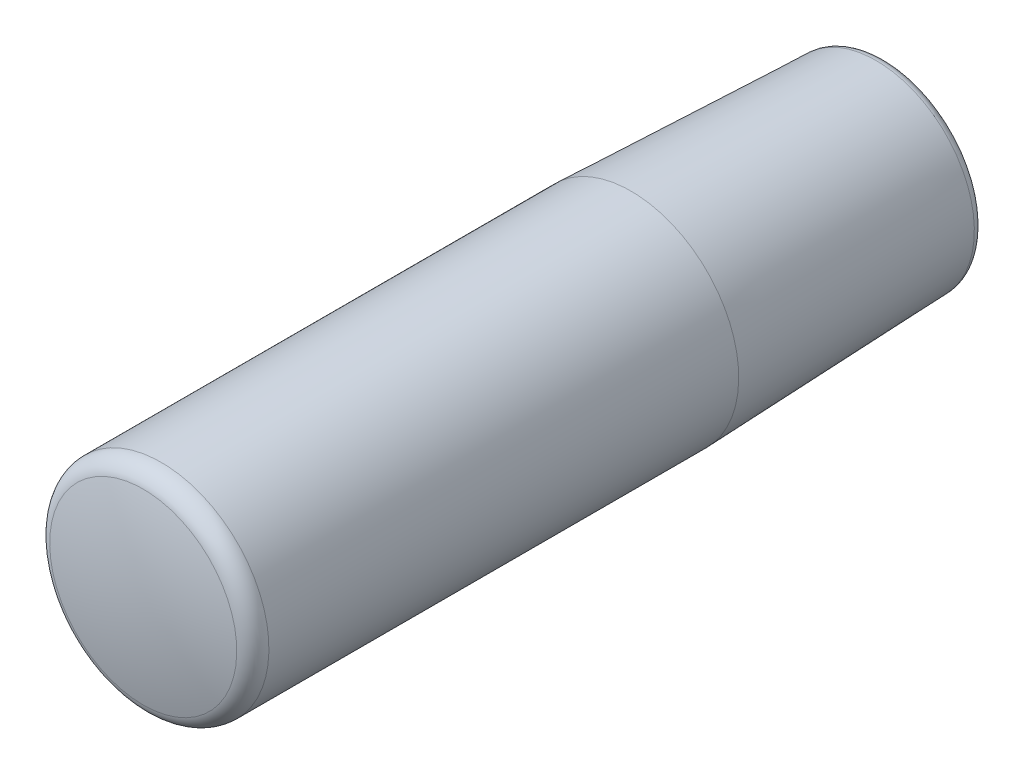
ISO-10303-21;
HEADER;
FILE_DESCRIPTION(('STEP AP214'),'2;1');
FILE_NAME('part.step','',(''),(''),'','','');
FILE_SCHEMA(('AUTOMOTIVE_DESIGN { 1 0 10303 214 1 1 1 1 }'));
ENDSEC;
DATA;
#1=APPLICATION_CONTEXT('core data for automotive mechanical design processes');
#2=APPLICATION_PROTOCOL_DEFINITION('international standard','automotive_design',2000,#1);
#3=PRODUCT_CONTEXT('',#1,'mechanical');
#4=PRODUCT('Part','Part','',(#3));
#5=PRODUCT_RELATED_PRODUCT_CATEGORY('part','',(#4));
#6=PRODUCT_DEFINITION_FORMATION('','',#4);
#7=PRODUCT_DEFINITION_CONTEXT('part definition',#1,'design');
#8=PRODUCT_DEFINITION('design','',#6,#7);
#9=PRODUCT_DEFINITION_SHAPE('','',#8);
#10=(LENGTH_UNIT() NAMED_UNIT(*) SI_UNIT(.MILLI.,.METRE.));
#11=(NAMED_UNIT(*) PLANE_ANGLE_UNIT() SI_UNIT($,.RADIAN.));
#12=(NAMED_UNIT(*) SI_UNIT($,.STERADIAN.) SOLID_ANGLE_UNIT());
#13=UNCERTAINTY_MEASURE_WITH_UNIT(LENGTH_MEASURE(1.E-05),#10,'distance_accuracy_value','');
#14=(GEOMETRIC_REPRESENTATION_CONTEXT(3) GLOBAL_UNCERTAINTY_ASSIGNED_CONTEXT((#13)) GLOBAL_UNIT_ASSIGNED_CONTEXT((#10,
#11,#12)) REPRESENTATION_CONTEXT('',''));
#15=CARTESIAN_POINT('',(0.,0.,0.));
#16=DIRECTION('',(0.,0.,1.));
#17=DIRECTION('',(1.,0.,0.));
#18=AXIS2_PLACEMENT_3D('',#15,#16,#17);
#19=CARTESIAN_POINT('',(0.,0.,1.));
#20=DIRECTION('',(0.,0.,-1.));
#21=DIRECTION('',(0.,-1.,0.));
#22=AXIS2_PLACEMENT_3D('',#19,#20,#21);
#23=TOROIDAL_SURFACE('',#22,9.03772216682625,1.);
#24=CARTESIAN_POINT('',(0.,0.,0.));
#25=DIRECTION('',(0.,0.,-1.));
#26=DIRECTION('',(0.,-1.,0.));
#27=AXIS2_PLACEMENT_3D('',#24,#25,#26);
#28=CIRCLE('',#27,9.03772216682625);
#29=CARTESIAN_POINT('',(0.,-9.03772216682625,0.));
#30=VERTEX_POINT('',#29);
#31=EDGE_CURVE('E8',#30,#30,#28,.T.);
#32=ORIENTED_EDGE('',*,*,#31,.F.);
#33=EDGE_LOOP('',(#32));
#34=FACE_BOUND('',#33,.T.);
#35=CARTESIAN_POINT('',(0.,0.,0.961566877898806));
#36=DIRECTION('',(0.,0.,-1.));
#37=DIRECTION('',(0.,-1.,0.));
#38=AXIS2_PLACEMENT_3D('',#35,#36,#37);
#39=CIRCLE('',#38,10.0369833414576);
#40=CARTESIAN_POINT('',(0.,-10.0369833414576,0.961566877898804));
#41=VERTEX_POINT('',#40);
#42=EDGE_CURVE('E34',#41,#41,#39,.T.);
#43=ORIENTED_EDGE('',*,*,#42,.T.);
#44=EDGE_LOOP('',(#43));
#45=FACE_BOUND('',#44,.T.);
#46=ADVANCED_FACE('F12',(#34,#45),#23,.T.);
#47=CARTESIAN_POINT('',(0.,9.0377221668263,0.));
#48=DIRECTION('',(0.,0.,1.));
#49=DIRECTION('',(0.,1.,0.));
#50=AXIS2_PLACEMENT_3D('',#47,#48,#49);
#51=PLANE('',#50);
#52=CARTESIAN_POINT('',(0.,0.,0.));
#53=DIRECTION('',(0.,0.,-1.));
#54=DIRECTION('',(0.,-1.,0.));
#55=AXIS2_PLACEMENT_3D('',#52,#53,#54);
#56=CIRCLE('',#55,5.);
#57=CARTESIAN_POINT('',(0.,-5.,0.));
#58=VERTEX_POINT('',#57);
#59=EDGE_CURVE('E18',#58,#58,#56,.T.);
#60=ORIENTED_EDGE('',*,*,#59,.F.);
#61=EDGE_LOOP('',(#60));
#62=FACE_BOUND('',#61,.T.);
#63=ORIENTED_EDGE('',*,*,#31,.T.);
#64=EDGE_LOOP('',(#63));
#65=FACE_BOUND('',#64,.T.);
#66=ADVANCED_FACE('F46',(#62,#65),#51,.F.);
#67=CARTESIAN_POINT('',(0.,0.,-2.5));
#68=DIRECTION('',(0.,0.,-1.));
#69=DIRECTION('',(0.,-1.,0.));
#70=AXIS2_PLACEMENT_3D('',#67,#68,#69);
#71=CYLINDRICAL_SURFACE('',#70,5.);
#72=CARTESIAN_POINT('',(0.,0.,15.));
#73=DIRECTION('',(0.,0.,-1.));
#74=DIRECTION('',(0.,1.,0.));
#75=AXIS2_PLACEMENT_3D('',#72,#73,#74);
#76=CIRCLE('',#75,5.);
#77=CARTESIAN_POINT('',(0.,5.,15.));
#78=VERTEX_POINT('',#77);
#79=EDGE_CURVE('E37',#78,#78,#76,.T.);
#80=ORIENTED_EDGE('',*,*,#79,.F.);
#81=EDGE_LOOP('',(#80));
#82=FACE_BOUND('',#81,.T.);
#83=ORIENTED_EDGE('',*,*,#59,.T.);
#84=EDGE_LOOP('',(#83));
#85=FACE_BOUND('',#84,.T.);
#86=ADVANCED_FACE('F43',(#82,#85),#71,.F.);
#87=CARTESIAN_POINT('',(0.,0.,37.));
#88=DIRECTION('',(-1.,0.,0.));
#89=DIRECTION('',(0.,0.,1.));
#90=AXIS2_PLACEMENT_3D('',#87,#88,#89);
#91=SPHERICAL_SURFACE('',#90,40.);
#92=CARTESIAN_POINT('',(0.,0.,37.));
#93=DIRECTION('',(0.,0.,-1.));
#94=DIRECTION('',(0.,-1.,0.));
#95=AXIS2_PLACEMENT_3D('',#92,#93,#94);
#96=SPHERICAL_SURFACE('',#95,40.);
#97=CARTESIAN_POINT('',(0.,0.,75.8416289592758));
#98=DIRECTION('',(0.,0.,-1.));
#99=DIRECTION('',(0.,-1.,0.));
#100=AXIS2_PLACEMENT_3D('',#97,#98,#99);
#101=CIRCLE('',#100,9.55656108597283);
#102=CARTESIAN_POINT('',(0.,-9.55656108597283,75.8416289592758));
#103=VERTEX_POINT('',#102);
#104=EDGE_CURVE('E22',#103,#103,#101,.T.);
#105=ORIENTED_EDGE('',*,*,#104,.F.);
#106=EDGE_LOOP('',(#105));
#107=FACE_BOUND('',#106,.T.);
#108=ADVANCED_FACE('F45',(#107),#96,.T.);
#109=CARTESIAN_POINT('',(0.,0.,74.));
#110=DIRECTION('',(0.,0.,-1.));
#111=DIRECTION('',(0.,-1.,0.));
#112=AXIS2_PLACEMENT_3D('',#109,#110,#111);
#113=TOROIDAL_SURFACE('',#112,9.10344827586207,1.89655172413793);
#114=CARTESIAN_POINT('',(0.,0.,74.));
#115=DIRECTION('',(0.,0.,-1.));
#116=DIRECTION('',(0.,-1.,0.));
#117=AXIS2_PLACEMENT_3D('',#114,#115,#116);
#118=CIRCLE('',#117,11.);
#119=CARTESIAN_POINT('',(0.,-11.,74.));
#120=VERTEX_POINT('',#119);
#121=EDGE_CURVE('E26',#120,#120,#118,.T.);
#122=ORIENTED_EDGE('',*,*,#121,.F.);
#123=EDGE_LOOP('',(#122));
#124=FACE_BOUND('',#123,.T.);
#125=ORIENTED_EDGE('',*,*,#104,.T.);
#126=EDGE_LOOP('',(#125));
#127=FACE_BOUND('',#126,.T.);
#128=ADVANCED_FACE('F53',(#124,#127),#113,.T.);
#129=CARTESIAN_POINT('',(0.,0.,-2.5));
#130=DIRECTION('',(0.,0.,-1.));
#131=DIRECTION('',(0.,-1.,0.));
#132=AXIS2_PLACEMENT_3D('',#129,#130,#131);
#133=CYLINDRICAL_SURFACE('',#132,11.);
#134=ORIENTED_EDGE('',*,*,#121,.T.);
#135=EDGE_LOOP('',(#134));
#136=FACE_BOUND('',#135,.T.);
#137=CARTESIAN_POINT('',(0.,0.,26.));
#138=DIRECTION('',(0.,0.,-1.));
#139=DIRECTION('',(0.,-1.,0.));
#140=AXIS2_PLACEMENT_3D('',#137,#138,#139);
#141=CIRCLE('',#140,11.);
#142=CARTESIAN_POINT('',(0.,-11.,26.));
#143=VERTEX_POINT('',#142);
#144=EDGE_CURVE('E31',#143,#143,#141,.T.);
#145=ORIENTED_EDGE('',*,*,#144,.F.);
#146=EDGE_LOOP('',(#145));
#147=FACE_BOUND('',#146,.T.);
#148=ADVANCED_FACE('F66',(#136,#147),#133,.T.);
#149=CARTESIAN_POINT('',(0.,0.,0.961566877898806));
#150=DIRECTION('',(0.,0.,1.));
#151=DIRECTION('',(0.,1.,0.));
#152=AXIS2_PLACEMENT_3D('',#149,#150,#151);
#153=CONICAL_SURFACE('',#152,10.0369833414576,0.0384425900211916);
#154=ORIENTED_EDGE('',*,*,#144,.T.);
#155=EDGE_LOOP('',(#154));
#156=FACE_BOUND('',#155,.T.);
#157=ORIENTED_EDGE('',*,*,#42,.F.);
#158=EDGE_LOOP('',(#157));
#159=FACE_BOUND('',#158,.T.);
#160=ADVANCED_FACE('F64',(#156,#159),#153,.T.);
#161=CARTESIAN_POINT('',(0.,0.,15.));
#162=DIRECTION('',(0.,0.,-1.));
#163=DIRECTION('',(0.,1.,0.));
#164=AXIS2_PLACEMENT_3D('',#161,#162,#163);
#165=PLANE('',#164);
#166=ORIENTED_EDGE('',*,*,#79,.T.);
#167=EDGE_LOOP('',(#166));
#168=FACE_BOUND('',#167,.T.);
#169=ADVANCED_FACE('F41',(#168),#165,.T.);
#170=CLOSED_SHELL('',(#46,#66,#86,#108,#128,#148,#160,#169));
#171=MANIFOLD_SOLID_BREP('B1',#170);
#172=ADVANCED_BREP_SHAPE_REPRESENTATION('',(#18,#171),#14);
#173=SHAPE_DEFINITION_REPRESENTATION(#9,#172);
ENDSEC;
END-ISO-10303-21;
